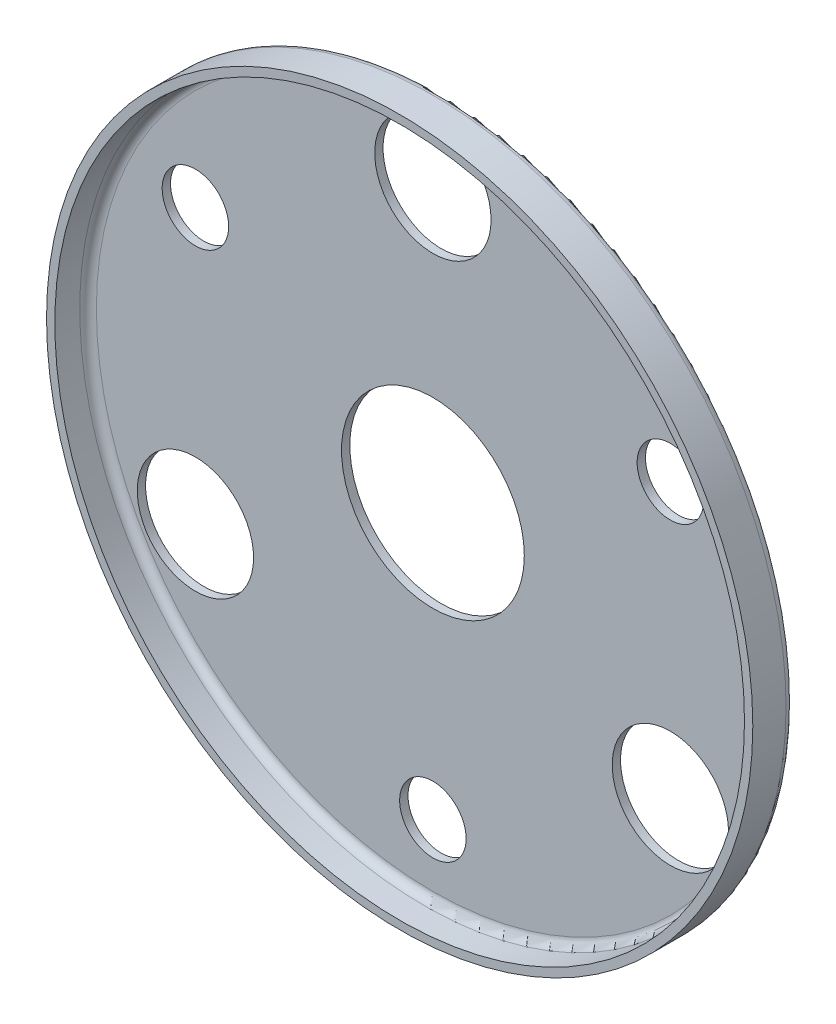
ISO-10303-21;
HEADER;
FILE_DESCRIPTION(('STEP AP214'),'2;1');
FILE_NAME('part.step','',(''),(''),'','','');
FILE_SCHEMA(('AUTOMOTIVE_DESIGN { 1 0 10303 214 1 1 1 1 }'));
ENDSEC;
DATA;
#1=APPLICATION_CONTEXT('core data for automotive mechanical design processes');
#2=APPLICATION_PROTOCOL_DEFINITION('international standard','automotive_design',2000,#1);
#3=PRODUCT_CONTEXT('',#1,'mechanical');
#4=PRODUCT('Part','Part','',(#3));
#5=PRODUCT_RELATED_PRODUCT_CATEGORY('part','',(#4));
#6=PRODUCT_DEFINITION_FORMATION('','',#4);
#7=PRODUCT_DEFINITION_CONTEXT('part definition',#1,'design');
#8=PRODUCT_DEFINITION('design','',#6,#7);
#9=PRODUCT_DEFINITION_SHAPE('','',#8);
#10=(LENGTH_UNIT() NAMED_UNIT(*) SI_UNIT(.MILLI.,.METRE.));
#11=(NAMED_UNIT(*) PLANE_ANGLE_UNIT() SI_UNIT($,.RADIAN.));
#12=(NAMED_UNIT(*) SI_UNIT($,.STERADIAN.) SOLID_ANGLE_UNIT());
#13=UNCERTAINTY_MEASURE_WITH_UNIT(LENGTH_MEASURE(1.E-05),#10,'distance_accuracy_value','');
#14=(GEOMETRIC_REPRESENTATION_CONTEXT(3) GLOBAL_UNCERTAINTY_ASSIGNED_CONTEXT((#13)) GLOBAL_UNIT_ASSIGNED_CONTEXT((#10,
#11,#12)) REPRESENTATION_CONTEXT('',''));
#15=CARTESIAN_POINT('',(0.,0.,0.));
#16=DIRECTION('',(0.,0.,1.));
#17=DIRECTION('',(1.,0.,0.));
#18=AXIS2_PLACEMENT_3D('',#15,#16,#17);
#19=CARTESIAN_POINT('',(0.,0.,5.));
#20=DIRECTION('',(0.,0.,-1.));
#21=DIRECTION('',(-1.,0.,0.));
#22=AXIS2_PLACEMENT_3D('',#19,#20,#21);
#23=CYLINDRICAL_SURFACE('',#22,42.5);
#24=CARTESIAN_POINT('',(0.,0.,1.));
#25=DIRECTION('',(0.,0.,1.));
#26=DIRECTION('',(1.,0.,0.));
#27=AXIS2_PLACEMENT_3D('',#24,#25,#26);
#28=CIRCLE('',#27,42.5);
#29=CARTESIAN_POINT('',(42.5,0.,1.));
#30=VERTEX_POINT('',#29);
#31=EDGE_CURVE('E43',#30,#30,#28,.T.);
#32=ORIENTED_EDGE('',*,*,#31,.T.);
#33=EDGE_LOOP('',(#32));
#34=FACE_BOUND('',#33,.T.);
#35=CARTESIAN_POINT('',(0.,0.,5.));
#36=DIRECTION('',(0.,0.,1.));
#37=DIRECTION('',(1.,0.,0.));
#38=AXIS2_PLACEMENT_3D('',#35,#36,#37);
#39=CIRCLE('',#38,42.5);
#40=CARTESIAN_POINT('',(42.5,0.,5.));
#41=VERTEX_POINT('',#40);
#42=EDGE_CURVE('E48',#41,#41,#39,.T.);
#43=ORIENTED_EDGE('',*,*,#42,.F.);
#44=EDGE_LOOP('',(#43));
#45=FACE_BOUND('',#44,.T.);
#46=ADVANCED_FACE('F29',(#34,#45),#23,.T.);
#47=CARTESIAN_POINT('',(0.,0.,5.));
#48=DIRECTION('',(0.,0.,1.));
#49=DIRECTION('',(1.,0.,0.));
#50=AXIS2_PLACEMENT_3D('',#47,#48,#49);
#51=PLANE('',#50);
#52=CARTESIAN_POINT('',(0.,0.,5.));
#53=DIRECTION('',(0.,0.,1.));
#54=DIRECTION('',(1.,0.,0.));
#55=AXIS2_PLACEMENT_3D('',#52,#53,#54);
#56=CIRCLE('',#55,41.5);
#57=CARTESIAN_POINT('',(41.5,0.,5.));
#58=VERTEX_POINT('',#57);
#59=EDGE_CURVE('E51',#58,#58,#56,.T.);
#60=ORIENTED_EDGE('',*,*,#59,.F.);
#61=EDGE_LOOP('',(#60));
#62=FACE_BOUND('',#61,.T.);
#63=ORIENTED_EDGE('',*,*,#42,.T.);
#64=EDGE_LOOP('',(#63));
#65=FACE_BOUND('',#64,.T.);
#66=ADVANCED_FACE('F134',(#62,#65),#51,.T.);
#67=CARTESIAN_POINT('',(0.,0.,0.));
#68=DIRECTION('',(0.,0.,1.));
#69=DIRECTION('',(1.,0.,0.));
#70=AXIS2_PLACEMENT_3D('',#67,#68,#69);
#71=PLANE('',#70);
#72=CARTESIAN_POINT('',(28.5788383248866,16.4999999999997,0.));
#73=DIRECTION('',(0.,0.,1.));
#74=DIRECTION('',(-0.499999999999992,0.866025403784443,0.));
#75=AXIS2_PLACEMENT_3D('',#72,#73,#74);
#76=CIRCLE('',#75,4.);
#77=CARTESIAN_POINT('',(26.5788383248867,19.9641016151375,0.));
#78=VERTEX_POINT('',#77);
#79=EDGE_CURVE('E90',#78,#78,#76,.T.);
#80=ORIENTED_EDGE('',*,*,#79,.T.);
#81=EDGE_LOOP('',(#80));
#82=FACE_BOUND('',#81,.T.);
#83=CARTESIAN_POINT('',(-28.5788383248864,16.5000000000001,0.));
#84=DIRECTION('',(0.,0.,1.));
#85=DIRECTION('',(-0.500000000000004,-0.866025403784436,0.));
#86=AXIS2_PLACEMENT_3D('',#83,#84,#85);
#87=CIRCLE('',#86,4.);
#88=CARTESIAN_POINT('',(-30.5788383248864,13.0358983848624,0.));
#89=VERTEX_POINT('',#88);
#90=EDGE_CURVE('E84',#89,#89,#87,.T.);
#91=ORIENTED_EDGE('',*,*,#90,.T.);
#92=EDGE_LOOP('',(#91));
#93=FACE_BOUND('',#92,.T.);
#94=CARTESIAN_POINT('',(0.,-33.,0.));
#95=DIRECTION('',(0.,0.,1.));
#96=DIRECTION('',(1.,0.,0.));
#97=AXIS2_PLACEMENT_3D('',#94,#95,#96);
#98=CIRCLE('',#97,4.);
#99=CARTESIAN_POINT('',(4.,-33.,0.));
#100=VERTEX_POINT('',#99);
#101=EDGE_CURVE('E78',#100,#100,#98,.T.);
#102=ORIENTED_EDGE('',*,*,#101,.T.);
#103=EDGE_LOOP('',(#102));
#104=FACE_BOUND('',#103,.T.);
#105=CARTESIAN_POINT('',(-28.5788383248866,-16.4999999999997,0.));
#106=DIRECTION('',(0.,0.,1.));
#107=DIRECTION('',(-0.499999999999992,0.866025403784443,0.));
#108=AXIS2_PLACEMENT_3D('',#105,#106,#107);
#109=CIRCLE('',#108,7.);
#110=CARTESIAN_POINT('',(-32.0788383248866,-10.4378221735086,0.));
#111=VERTEX_POINT('',#110);
#112=EDGE_CURVE('E72',#111,#111,#109,.T.);
#113=ORIENTED_EDGE('',*,*,#112,.T.);
#114=EDGE_LOOP('',(#113));
#115=FACE_BOUND('',#114,.T.);
#116=CARTESIAN_POINT('',(28.5788383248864,-16.5000000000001,0.));
#117=DIRECTION('',(0.,0.,1.));
#118=DIRECTION('',(-0.500000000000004,-0.866025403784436,0.));
#119=AXIS2_PLACEMENT_3D('',#116,#117,#118);
#120=CIRCLE('',#119,7.);
#121=CARTESIAN_POINT('',(25.0788383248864,-22.5621778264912,0.));
#122=VERTEX_POINT('',#121);
#123=EDGE_CURVE('E66',#122,#122,#120,.T.);
#124=ORIENTED_EDGE('',*,*,#123,.T.);
#125=EDGE_LOOP('',(#124));
#126=FACE_BOUND('',#125,.T.);
#127=CARTESIAN_POINT('',(0.,33.,0.));
#128=DIRECTION('',(0.,0.,1.));
#129=DIRECTION('',(1.,0.,0.));
#130=AXIS2_PLACEMENT_3D('',#127,#128,#129);
#131=CIRCLE('',#130,7.);
#132=CARTESIAN_POINT('',(7.,33.,0.));
#133=VERTEX_POINT('',#132);
#134=EDGE_CURVE('E60',#133,#133,#131,.T.);
#135=ORIENTED_EDGE('',*,*,#134,.T.);
#136=EDGE_LOOP('',(#135));
#137=FACE_BOUND('',#136,.T.);
#138=CARTESIAN_POINT('',(0.,0.,0.));
#139=DIRECTION('',(0.,0.,1.));
#140=DIRECTION('',(1.,0.,0.));
#141=AXIS2_PLACEMENT_3D('',#138,#139,#140);
#142=CIRCLE('',#141,11.);
#143=CARTESIAN_POINT('',(11.,0.,0.));
#144=VERTEX_POINT('',#143);
#145=EDGE_CURVE('E54',#144,#144,#142,.T.);
#146=ORIENTED_EDGE('',*,*,#145,.T.);
#147=EDGE_LOOP('',(#146));
#148=FACE_BOUND('',#147,.T.);
#149=CARTESIAN_POINT('',(0.,0.,0.));
#150=DIRECTION('',(0.,0.,1.));
#151=DIRECTION('',(1.,0.,0.));
#152=AXIS2_PLACEMENT_3D('',#149,#150,#151);
#153=CIRCLE('',#152,41.5);
#154=CARTESIAN_POINT('',(41.5,0.,0.));
#155=VERTEX_POINT('',#154);
#156=EDGE_CURVE('E39',#155,#155,#153,.F.);
#157=ORIENTED_EDGE('',*,*,#156,.T.);
#158=EDGE_LOOP('',(#157));
#159=FACE_BOUND('',#158,.T.);
#160=ADVANCED_FACE('F140',(#82,#93,#104,#115,#126,#137,#148,#159),#71,.F.);
#161=CARTESIAN_POINT('',(0.,0.,1.));
#162=DIRECTION('',(0.,0.,1.));
#163=DIRECTION('',(1.,0.,0.));
#164=AXIS2_PLACEMENT_3D('',#161,#162,#163);
#165=CYLINDRICAL_SURFACE('',#164,41.5);
#166=CARTESIAN_POINT('',(0.,0.,2.));
#167=DIRECTION('',(0.,0.,1.));
#168=DIRECTION('',(1.,0.,0.));
#169=AXIS2_PLACEMENT_3D('',#166,#167,#168);
#170=CIRCLE('',#169,41.5);
#171=CARTESIAN_POINT('',(41.5,0.,2.));
#172=VERTEX_POINT('',#171);
#173=EDGE_CURVE('E10',#172,#172,#170,.F.);
#174=ORIENTED_EDGE('',*,*,#173,.T.);
#175=EDGE_LOOP('',(#174));
#176=FACE_BOUND('',#175,.T.);
#177=ORIENTED_EDGE('',*,*,#59,.T.);
#178=EDGE_LOOP('',(#177));
#179=FACE_BOUND('',#178,.T.);
#180=ADVANCED_FACE('F103',(#176,#179),#165,.F.);
#181=CARTESIAN_POINT('',(0.,0.,1.));
#182=DIRECTION('',(0.,0.,1.));
#183=DIRECTION('',(1.,0.,0.));
#184=AXIS2_PLACEMENT_3D('',#181,#182,#183);
#185=PLANE('',#184);
#186=CARTESIAN_POINT('',(28.5788383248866,16.4999999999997,1.));
#187=DIRECTION('',(0.,0.,1.));
#188=DIRECTION('',(-0.499999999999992,0.866025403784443,0.));
#189=AXIS2_PLACEMENT_3D('',#186,#187,#188);
#190=CIRCLE('',#189,4.);
#191=CARTESIAN_POINT('',(26.5788383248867,19.9641016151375,1.));
#192=VERTEX_POINT('',#191);
#193=EDGE_CURVE('E93',#192,#192,#190,.T.);
#194=ORIENTED_EDGE('',*,*,#193,.F.);
#195=EDGE_LOOP('',(#194));
#196=FACE_BOUND('',#195,.T.);
#197=CARTESIAN_POINT('',(-28.5788383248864,16.5000000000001,1.));
#198=DIRECTION('',(0.,0.,1.));
#199=DIRECTION('',(-0.500000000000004,-0.866025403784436,0.));
#200=AXIS2_PLACEMENT_3D('',#197,#198,#199);
#201=CIRCLE('',#200,4.);
#202=CARTESIAN_POINT('',(-30.5788383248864,13.0358983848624,1.));
#203=VERTEX_POINT('',#202);
#204=EDGE_CURVE('E87',#203,#203,#201,.T.);
#205=ORIENTED_EDGE('',*,*,#204,.F.);
#206=EDGE_LOOP('',(#205));
#207=FACE_BOUND('',#206,.T.);
#208=CARTESIAN_POINT('',(0.,-33.,1.));
#209=DIRECTION('',(0.,0.,1.));
#210=DIRECTION('',(1.,0.,0.));
#211=AXIS2_PLACEMENT_3D('',#208,#209,#210);
#212=CIRCLE('',#211,4.);
#213=CARTESIAN_POINT('',(4.,-33.,1.));
#214=VERTEX_POINT('',#213);
#215=EDGE_CURVE('E81',#214,#214,#212,.T.);
#216=ORIENTED_EDGE('',*,*,#215,.F.);
#217=EDGE_LOOP('',(#216));
#218=FACE_BOUND('',#217,.T.);
#219=CARTESIAN_POINT('',(-28.5788383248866,-16.4999999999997,1.));
#220=DIRECTION('',(0.,0.,1.));
#221=DIRECTION('',(-0.499999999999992,0.866025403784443,0.));
#222=AXIS2_PLACEMENT_3D('',#219,#220,#221);
#223=CIRCLE('',#222,7.);
#224=CARTESIAN_POINT('',(-32.0788383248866,-10.4378221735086,1.));
#225=VERTEX_POINT('',#224);
#226=EDGE_CURVE('E75',#225,#225,#223,.T.);
#227=ORIENTED_EDGE('',*,*,#226,.F.);
#228=EDGE_LOOP('',(#227));
#229=FACE_BOUND('',#228,.T.);
#230=CARTESIAN_POINT('',(28.5788383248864,-16.5000000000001,1.));
#231=DIRECTION('',(0.,0.,1.));
#232=DIRECTION('',(-0.500000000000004,-0.866025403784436,0.));
#233=AXIS2_PLACEMENT_3D('',#230,#231,#232);
#234=CIRCLE('',#233,7.);
#235=CARTESIAN_POINT('',(25.0788383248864,-22.5621778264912,1.));
#236=VERTEX_POINT('',#235);
#237=EDGE_CURVE('E69',#236,#236,#234,.T.);
#238=ORIENTED_EDGE('',*,*,#237,.F.);
#239=EDGE_LOOP('',(#238));
#240=FACE_BOUND('',#239,.T.);
#241=CARTESIAN_POINT('',(0.,33.,1.));
#242=DIRECTION('',(0.,0.,1.));
#243=DIRECTION('',(1.,0.,0.));
#244=AXIS2_PLACEMENT_3D('',#241,#242,#243);
#245=CIRCLE('',#244,7.);
#246=CARTESIAN_POINT('',(7.,33.,1.));
#247=VERTEX_POINT('',#246);
#248=EDGE_CURVE('E63',#247,#247,#245,.T.);
#249=ORIENTED_EDGE('',*,*,#248,.F.);
#250=EDGE_LOOP('',(#249));
#251=FACE_BOUND('',#250,.T.);
#252=CARTESIAN_POINT('',(0.,0.,1.));
#253=DIRECTION('',(0.,0.,1.));
#254=DIRECTION('',(1.,0.,0.));
#255=AXIS2_PLACEMENT_3D('',#252,#253,#254);
#256=CIRCLE('',#255,11.);
#257=CARTESIAN_POINT('',(11.,0.,1.));
#258=VERTEX_POINT('',#257);
#259=EDGE_CURVE('E57',#258,#258,#256,.T.);
#260=ORIENTED_EDGE('',*,*,#259,.F.);
#261=EDGE_LOOP('',(#260));
#262=FACE_BOUND('',#261,.T.);
#263=CARTESIAN_POINT('',(0.,0.,1.));
#264=DIRECTION('',(0.,0.,1.));
#265=DIRECTION('',(1.,0.,0.));
#266=AXIS2_PLACEMENT_3D('',#263,#264,#265);
#267=CIRCLE('',#266,40.5);
#268=CARTESIAN_POINT('',(40.5,0.,1.));
#269=VERTEX_POINT('',#268);
#270=EDGE_CURVE('E35',#269,#269,#267,.T.);
#271=ORIENTED_EDGE('',*,*,#270,.T.);
#272=EDGE_LOOP('',(#271));
#273=FACE_BOUND('',#272,.T.);
#274=ADVANCED_FACE('F99',(#196,#207,#218,#229,#240,#251,#262,#273),#185,.T.);
#275=CARTESIAN_POINT('',(0.,0.,1.));
#276=DIRECTION('',(0.,0.,1.));
#277=DIRECTION('',(1.,0.,0.));
#278=AXIS2_PLACEMENT_3D('',#275,#276,#277);
#279=TOROIDAL_SURFACE('',#278,41.5,1.);
#280=ORIENTED_EDGE('',*,*,#156,.F.);
#281=EDGE_LOOP('',(#280));
#282=FACE_BOUND('',#281,.T.);
#283=ORIENTED_EDGE('',*,*,#31,.F.);
#284=EDGE_LOOP('',(#283));
#285=FACE_BOUND('',#284,.T.);
#286=ADVANCED_FACE('F102',(#282,#285),#279,.T.);
#287=CARTESIAN_POINT('',(0.,0.,2.));
#288=DIRECTION('',(0.,0.,1.));
#289=DIRECTION('',(1.,0.,0.));
#290=AXIS2_PLACEMENT_3D('',#287,#288,#289);
#291=TOROIDAL_SURFACE('',#290,40.5,1.);
#292=ORIENTED_EDGE('',*,*,#173,.F.);
#293=EDGE_LOOP('',(#292));
#294=FACE_BOUND('',#293,.T.);
#295=ORIENTED_EDGE('',*,*,#270,.F.);
#296=EDGE_LOOP('',(#295));
#297=FACE_BOUND('',#296,.T.);
#298=ADVANCED_FACE('F120',(#294,#297),#291,.F.);
#299=CARTESIAN_POINT('',(0.,0.,0.));
#300=DIRECTION('',(0.,0.,1.));
#301=DIRECTION('',(1.,0.,0.));
#302=AXIS2_PLACEMENT_3D('',#299,#300,#301);
#303=CYLINDRICAL_SURFACE('',#302,11.);
#304=ORIENTED_EDGE('',*,*,#145,.F.);
#305=EDGE_LOOP('',(#304));
#306=FACE_BOUND('',#305,.T.);
#307=ORIENTED_EDGE('',*,*,#259,.T.);
#308=EDGE_LOOP('',(#307));
#309=FACE_BOUND('',#308,.T.);
#310=ADVANCED_FACE('F117',(#306,#309),#303,.F.);
#311=CARTESIAN_POINT('',(0.,33.,0.));
#312=DIRECTION('',(0.,0.,1.));
#313=DIRECTION('',(1.,0.,0.));
#314=AXIS2_PLACEMENT_3D('',#311,#312,#313);
#315=CYLINDRICAL_SURFACE('',#314,7.);
#316=ORIENTED_EDGE('',*,*,#134,.F.);
#317=EDGE_LOOP('',(#316));
#318=FACE_BOUND('',#317,.T.);
#319=ORIENTED_EDGE('',*,*,#248,.T.);
#320=EDGE_LOOP('',(#319));
#321=FACE_BOUND('',#320,.T.);
#322=ADVANCED_FACE('F119',(#318,#321),#315,.F.);
#323=CARTESIAN_POINT('',(28.5788383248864,-16.5000000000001,0.));
#324=DIRECTION('',(0.,0.,1.));
#325=DIRECTION('',(1.,0.,0.));
#326=AXIS2_PLACEMENT_3D('',#323,#324,#325);
#327=CYLINDRICAL_SURFACE('',#326,7.);
#328=ORIENTED_EDGE('',*,*,#123,.F.);
#329=EDGE_LOOP('',(#328));
#330=FACE_BOUND('',#329,.T.);
#331=ORIENTED_EDGE('',*,*,#237,.T.);
#332=EDGE_LOOP('',(#331));
#333=FACE_BOUND('',#332,.T.);
#334=ADVANCED_FACE('F127',(#330,#333),#327,.F.);
#335=CARTESIAN_POINT('',(-28.5788383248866,-16.4999999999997,0.));
#336=DIRECTION('',(0.,0.,1.));
#337=DIRECTION('',(1.,0.,0.));
#338=AXIS2_PLACEMENT_3D('',#335,#336,#337);
#339=CYLINDRICAL_SURFACE('',#338,7.);
#340=ORIENTED_EDGE('',*,*,#112,.F.);
#341=EDGE_LOOP('',(#340));
#342=FACE_BOUND('',#341,.T.);
#343=ORIENTED_EDGE('',*,*,#226,.T.);
#344=EDGE_LOOP('',(#343));
#345=FACE_BOUND('',#344,.T.);
#346=ADVANCED_FACE('F177',(#342,#345),#339,.F.);
#347=CARTESIAN_POINT('',(0.,-33.,0.));
#348=DIRECTION('',(0.,0.,1.));
#349=DIRECTION('',(1.,0.,0.));
#350=AXIS2_PLACEMENT_3D('',#347,#348,#349);
#351=CYLINDRICAL_SURFACE('',#350,4.);
#352=ORIENTED_EDGE('',*,*,#101,.F.);
#353=EDGE_LOOP('',(#352));
#354=FACE_BOUND('',#353,.T.);
#355=ORIENTED_EDGE('',*,*,#215,.T.);
#356=EDGE_LOOP('',(#355));
#357=FACE_BOUND('',#356,.T.);
#358=ADVANCED_FACE('F182',(#354,#357),#351,.F.);
#359=CARTESIAN_POINT('',(-28.5788383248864,16.5000000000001,0.));
#360=DIRECTION('',(0.,0.,1.));
#361=DIRECTION('',(1.,0.,0.));
#362=AXIS2_PLACEMENT_3D('',#359,#360,#361);
#363=CYLINDRICAL_SURFACE('',#362,4.);
#364=ORIENTED_EDGE('',*,*,#90,.F.);
#365=EDGE_LOOP('',(#364));
#366=FACE_BOUND('',#365,.T.);
#367=ORIENTED_EDGE('',*,*,#204,.T.);
#368=EDGE_LOOP('',(#367));
#369=FACE_BOUND('',#368,.T.);
#370=ADVANCED_FACE('F187',(#366,#369),#363,.F.);
#371=CARTESIAN_POINT('',(28.5788383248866,16.4999999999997,0.));
#372=DIRECTION('',(0.,0.,1.));
#373=DIRECTION('',(1.,0.,0.));
#374=AXIS2_PLACEMENT_3D('',#371,#372,#373);
#375=CYLINDRICAL_SURFACE('',#374,4.);
#376=ORIENTED_EDGE('',*,*,#79,.F.);
#377=EDGE_LOOP('',(#376));
#378=FACE_BOUND('',#377,.T.);
#379=ORIENTED_EDGE('',*,*,#193,.T.);
#380=EDGE_LOOP('',(#379));
#381=FACE_BOUND('',#380,.T.);
#382=ADVANCED_FACE('F97',(#378,#381),#375,.F.);
#383=CLOSED_SHELL('',(#46,#66,#160,#180,#274,#286,#298,#310,#322,#334,#346,#358,#370,#382));
#384=MANIFOLD_SOLID_BREP('B2',#383);
#385=ADVANCED_BREP_SHAPE_REPRESENTATION('',(#18,#384),#14);
#386=SHAPE_DEFINITION_REPRESENTATION(#9,#385);
ENDSEC;
END-ISO-10303-21;
